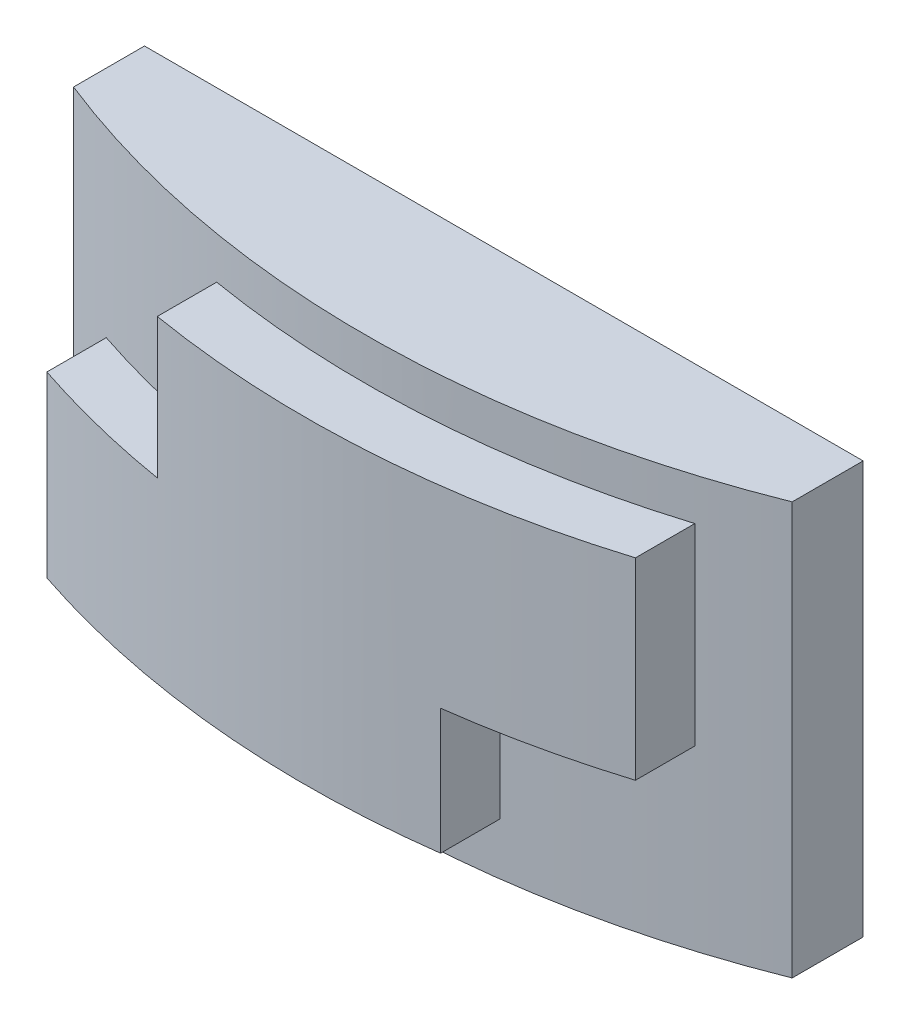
ISO-10303-21;
HEADER;
FILE_DESCRIPTION(('STEP AP214'),'2;1');
FILE_NAME('part.step','',(''),(''),'','','');
FILE_SCHEMA(('AUTOMOTIVE_DESIGN { 1 0 10303 214 1 1 1 1 }'));
ENDSEC;
DATA;
#1=APPLICATION_CONTEXT('core data for automotive mechanical design processes');
#2=APPLICATION_PROTOCOL_DEFINITION('international standard','automotive_design',2000,#1);
#3=PRODUCT_CONTEXT('',#1,'mechanical');
#4=PRODUCT('Part','Part','',(#3));
#5=PRODUCT_RELATED_PRODUCT_CATEGORY('part','',(#4));
#6=PRODUCT_DEFINITION_FORMATION('','',#4);
#7=PRODUCT_DEFINITION_CONTEXT('part definition',#1,'design');
#8=PRODUCT_DEFINITION('design','',#6,#7);
#9=PRODUCT_DEFINITION_SHAPE('','',#8);
#10=(LENGTH_UNIT() NAMED_UNIT(*) SI_UNIT(.MILLI.,.METRE.));
#11=(NAMED_UNIT(*) PLANE_ANGLE_UNIT() SI_UNIT($,.RADIAN.));
#12=(NAMED_UNIT(*) SI_UNIT($,.STERADIAN.) SOLID_ANGLE_UNIT());
#13=UNCERTAINTY_MEASURE_WITH_UNIT(LENGTH_MEASURE(1.E-05),#10,'distance_accuracy_value','');
#14=(GEOMETRIC_REPRESENTATION_CONTEXT(3) GLOBAL_UNCERTAINTY_ASSIGNED_CONTEXT((#13)) GLOBAL_UNIT_ASSIGNED_CONTEXT((#10,
#11,#12)) REPRESENTATION_CONTEXT('',''));
#15=CARTESIAN_POINT('',(0.,0.,0.));
#16=DIRECTION('',(0.,0.,1.));
#17=DIRECTION('',(1.,0.,0.));
#18=AXIS2_PLACEMENT_3D('',#15,#16,#17);
#19=CARTESIAN_POINT('',(1.12058823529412,69.4428014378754,-152.267457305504));
#20=DIRECTION('',(0.,-1.,0.));
#21=DIRECTION('',(0.,0.,-1.));
#22=AXIS2_PLACEMENT_3D('',#19,#20,#21);
#23=CYLINDRICAL_SURFACE('',#22,163.850701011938);
#24=CARTESIAN_POINT('',(1.12058823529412,38.8031000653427,-152.267457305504));
#25=DIRECTION('',(0.,-1.,0.));
#26=DIRECTION('',(0.,0.,-1.));
#27=AXIS2_PLACEMENT_3D('',#24,#25,#26);
#28=CIRCLE('',#27,163.850701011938);
#29=CARTESIAN_POINT('',(-25.9572192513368,38.8031000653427,9.33032907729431));
#30=VERTEX_POINT('',#29);
#31=CARTESIAN_POINT('',(-50.712715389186,38.8031000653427,3.16857731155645));
#32=VERTEX_POINT('',#31);
#33=EDGE_CURVE('E47',#30,#32,#28,.T.);
#34=ORIENTED_EDGE('',*,*,#33,.F.);
#35=DIRECTION('',(0.,-1.,0.));
#36=VECTOR('',#35,1.);
#37=CARTESIAN_POINT('',(-25.9572192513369,69.4428014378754,9.33032907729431));
#38=LINE('',#37,#36);
#39=CARTESIAN_POINT('',(-25.9572192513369,62.356873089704,9.33032907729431));
#40=VERTEX_POINT('',#39);
#41=EDGE_CURVE('E125',#40,#30,#38,.T.);
#42=ORIENTED_EDGE('',*,*,#41,.F.);
#43=CARTESIAN_POINT('',(1.12058823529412,62.356873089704,-152.267457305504));
#44=DIRECTION('',(0.,-1.,0.));
#45=DIRECTION('',(1.,0.,0.));
#46=AXIS2_PLACEMENT_3D('',#43,#44,#45);
#47=CIRCLE('',#46,163.850701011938);
#48=CARTESIAN_POINT('',(49.5109922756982,62.3568730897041,4.27461697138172));
#49=VERTEX_POINT('',#48);
#50=EDGE_CURVE('E118',#49,#40,#47,.T.);
#51=ORIENTED_EDGE('',*,*,#50,.F.);
#52=DIRECTION('',(0.,-1.,0.));
#53=VECTOR('',#52,1.);
#54=CARTESIAN_POINT('',(49.5109922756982,69.4428014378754,4.27461697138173));
#55=LINE('',#54,#53);
#56=CARTESIAN_POINT('',(49.5109922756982,29.9103490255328,4.27461697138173));
#57=VERTEX_POINT('',#56);
#58=EDGE_CURVE('E122',#49,#57,#55,.T.);
#59=ORIENTED_EDGE('',*,*,#58,.T.);
#60=CARTESIAN_POINT('',(1.12058823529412,29.9103490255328,-152.267457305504));
#61=DIRECTION('',(0.,1.,0.));
#62=DIRECTION('',(0.,0.,1.));
#63=AXIS2_PLACEMENT_3D('',#60,#61,#62);
#64=CIRCLE('',#63,163.850701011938);
#65=CARTESIAN_POINT('',(22.592394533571,29.9103490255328,10.1702653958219));
#66=VERTEX_POINT('',#65);
#67=EDGE_CURVE('E148',#66,#57,#64,.T.);
#68=ORIENTED_EDGE('',*,*,#67,.F.);
#69=DIRECTION('',(0.,-1.,0.));
#70=VECTOR('',#69,1.);
#71=CARTESIAN_POINT('',(22.592394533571,69.4428014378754,10.1702653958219));
#72=LINE('',#71,#70);
#73=CARTESIAN_POINT('',(22.592394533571,8.76002222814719,10.1702653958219));
#74=VERTEX_POINT('',#73);
#75=EDGE_CURVE('E154',#66,#74,#72,.T.);
#76=ORIENTED_EDGE('',*,*,#75,.T.);
#77=CARTESIAN_POINT('',(1.12058823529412,8.76002222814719,-152.267457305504));
#78=DIRECTION('',(0.,1.,0.));
#79=DIRECTION('',(-1.,0.,0.));
#80=AXIS2_PLACEMENT_3D('',#77,#78,#79);
#81=CIRCLE('',#80,163.850701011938);
#82=CARTESIAN_POINT('',(-50.712715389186,8.7600222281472,3.16857731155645));
#83=VERTEX_POINT('',#82);
#84=EDGE_CURVE('E158',#83,#74,#81,.T.);
#85=ORIENTED_EDGE('',*,*,#84,.F.);
#86=DIRECTION('',(0.,-1.,0.));
#87=VECTOR('',#86,1.);
#88=CARTESIAN_POINT('',(-50.712715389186,69.4428014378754,3.16857731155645));
#89=LINE('',#88,#87);
#90=EDGE_CURVE('E52',#32,#83,#89,.T.);
#91=ORIENTED_EDGE('',*,*,#90,.F.);
#92=EDGE_LOOP('',(#34,#42,#51,#59,#68,#76,#85,#91));
#93=FACE_BOUND('',#92,.T.);
#94=CARTESIAN_POINT('',(1.12058823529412,0.,-152.267457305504));
#95=DIRECTION('',(0.,1.,0.));
#96=DIRECTION('',(0.,0.,1.));
#97=AXIS2_PLACEMENT_3D('',#94,#95,#96);
#98=CIRCLE('',#97,163.850701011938);
#99=CARTESIAN_POINT('',(-59.3911764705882,0.,0.));
#100=VERTEX_POINT('',#99);
#101=CARTESIAN_POINT('',(61.6323529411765,0.,0.));
#102=VERTEX_POINT('',#101);
#103=EDGE_CURVE('E183',#100,#102,#98,.T.);
#104=ORIENTED_EDGE('',*,*,#103,.T.);
#105=DIRECTION('',(0.,-1.,0.));
#106=VECTOR('',#105,1.);
#107=CARTESIAN_POINT('',(61.6323529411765,69.4428014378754,0.));
#108=LINE('',#107,#106);
#109=CARTESIAN_POINT('',(61.6323529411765,69.4428014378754,0.));
#110=VERTEX_POINT('',#109);
#111=EDGE_CURVE('E11',#110,#102,#108,.T.);
#112=ORIENTED_EDGE('',*,*,#111,.F.);
#113=CARTESIAN_POINT('',(1.12058823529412,69.4428014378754,-152.267457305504));
#114=DIRECTION('',(0.,1.,0.));
#115=DIRECTION('',(0.,0.,1.));
#116=AXIS2_PLACEMENT_3D('',#113,#114,#115);
#117=CIRCLE('',#116,163.850701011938);
#118=CARTESIAN_POINT('',(-59.3911764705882,69.4428014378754,0.));
#119=VERTEX_POINT('',#118);
#120=EDGE_CURVE('E192',#119,#110,#117,.T.);
#121=ORIENTED_EDGE('',*,*,#120,.F.);
#122=DIRECTION('',(0.,-1.,0.));
#123=VECTOR('',#122,1.);
#124=CARTESIAN_POINT('',(-59.3911764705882,69.4428014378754,0.));
#125=LINE('',#124,#123);
#126=EDGE_CURVE('E201',#119,#100,#125,.T.);
#127=ORIENTED_EDGE('',*,*,#126,.T.);
#128=EDGE_LOOP('',(#104,#112,#121,#127));
#129=FACE_BOUND('',#128,.T.);
#130=ADVANCED_FACE('F33',(#93,#129),#23,.T.);
#131=CARTESIAN_POINT('',(61.6323529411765,69.4428014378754,-11.9529411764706));
#132=DIRECTION('',(-1.,0.,0.));
#133=DIRECTION('',(0.,0.,1.));
#134=AXIS2_PLACEMENT_3D('',#131,#132,#133);
#135=PLANE('',#134);
#136=DIRECTION('',(0.,0.,-1.));
#137=VECTOR('',#136,1.);
#138=CARTESIAN_POINT('',(61.6323529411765,0.,-11.9529411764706));
#139=LINE('',#138,#137);
#140=CARTESIAN_POINT('',(61.6323529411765,0.,-11.9529411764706));
#141=VERTEX_POINT('',#140);
#142=EDGE_CURVE('E186',#102,#141,#139,.T.);
#143=ORIENTED_EDGE('',*,*,#142,.T.);
#144=DIRECTION('',(0.,-1.,0.));
#145=VECTOR('',#144,1.);
#146=CARTESIAN_POINT('',(61.6323529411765,69.4428014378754,-11.9529411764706));
#147=LINE('',#146,#145);
#148=CARTESIAN_POINT('',(61.6323529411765,69.4428014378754,-11.9529411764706));
#149=VERTEX_POINT('',#148);
#150=EDGE_CURVE('E40',#149,#141,#147,.T.);
#151=ORIENTED_EDGE('',*,*,#150,.F.);
#152=DIRECTION('',(0.,0.,-1.));
#153=VECTOR('',#152,1.);
#154=CARTESIAN_POINT('',(61.6323529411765,69.4428014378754,-11.9529411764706));
#155=LINE('',#154,#153);
#156=EDGE_CURVE('E195',#110,#149,#155,.T.);
#157=ORIENTED_EDGE('',*,*,#156,.F.);
#158=ORIENTED_EDGE('',*,*,#111,.T.);
#159=EDGE_LOOP('',(#143,#151,#157,#158));
#160=FACE_BOUND('',#159,.T.);
#161=ADVANCED_FACE('F226',(#160),#135,.F.);
#162=CARTESIAN_POINT('',(-59.3911764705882,69.4428014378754,-11.9529411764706));
#163=DIRECTION('',(0.,0.,1.));
#164=DIRECTION('',(1.,0.,0.));
#165=AXIS2_PLACEMENT_3D('',#162,#163,#164);
#166=PLANE('',#165);
#167=DIRECTION('',(-1.,0.,0.));
#168=VECTOR('',#167,1.);
#169=CARTESIAN_POINT('',(-59.3911764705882,0.,-11.9529411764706));
#170=LINE('',#169,#168);
#171=CARTESIAN_POINT('',(-59.3911764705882,0.,-11.9529411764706));
#172=VERTEX_POINT('',#171);
#173=EDGE_CURVE('E188',#141,#172,#170,.T.);
#174=ORIENTED_EDGE('',*,*,#173,.T.);
#175=DIRECTION('',(0.,-1.,0.));
#176=VECTOR('',#175,1.);
#177=CARTESIAN_POINT('',(-59.3911764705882,69.4428014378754,-11.9529411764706));
#178=LINE('',#177,#176);
#179=CARTESIAN_POINT('',(-59.3911764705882,69.4428014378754,-11.9529411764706));
#180=VERTEX_POINT('',#179);
#181=EDGE_CURVE('E204',#180,#172,#178,.T.);
#182=ORIENTED_EDGE('',*,*,#181,.F.);
#183=DIRECTION('',(-1.,0.,0.));
#184=VECTOR('',#183,1.);
#185=CARTESIAN_POINT('',(-59.3911764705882,69.4428014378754,-11.9529411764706));
#186=LINE('',#185,#184);
#187=EDGE_CURVE('E197',#149,#180,#186,.T.);
#188=ORIENTED_EDGE('',*,*,#187,.F.);
#189=ORIENTED_EDGE('',*,*,#150,.T.);
#190=EDGE_LOOP('',(#174,#182,#188,#189));
#191=FACE_BOUND('',#190,.T.);
#192=ADVANCED_FACE('F211',(#191),#166,.F.);
#193=CARTESIAN_POINT('',(-59.3911764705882,69.4428014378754,0.));
#194=DIRECTION('',(1.,0.,0.));
#195=DIRECTION('',(0.,0.,-1.));
#196=AXIS2_PLACEMENT_3D('',#193,#194,#195);
#197=PLANE('',#196);
#198=DIRECTION('',(0.,0.,1.));
#199=VECTOR('',#198,1.);
#200=CARTESIAN_POINT('',(-59.3911764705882,0.,0.));
#201=LINE('',#200,#199);
#202=EDGE_CURVE('E190',#172,#100,#201,.T.);
#203=ORIENTED_EDGE('',*,*,#202,.T.);
#204=ORIENTED_EDGE('',*,*,#126,.F.);
#205=DIRECTION('',(0.,0.,1.));
#206=VECTOR('',#205,1.);
#207=CARTESIAN_POINT('',(-59.3911764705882,69.4428014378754,0.));
#208=LINE('',#207,#206);
#209=EDGE_CURVE('E199',#180,#119,#208,.T.);
#210=ORIENTED_EDGE('',*,*,#209,.F.);
#211=ORIENTED_EDGE('',*,*,#181,.T.);
#212=EDGE_LOOP('',(#203,#204,#210,#211));
#213=FACE_BOUND('',#212,.T.);
#214=ADVANCED_FACE('F220',(#213),#197,.F.);
#215=CARTESIAN_POINT('',(1.12058823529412,69.4428014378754,-152.267457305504));
#216=DIRECTION('',(0.,1.,0.));
#217=DIRECTION('',(0.,0.,1.));
#218=AXIS2_PLACEMENT_3D('',#215,#216,#217);
#219=PLANE('',#218);
#220=ORIENTED_EDGE('',*,*,#120,.T.);
#221=ORIENTED_EDGE('',*,*,#156,.T.);
#222=ORIENTED_EDGE('',*,*,#187,.T.);
#223=ORIENTED_EDGE('',*,*,#209,.T.);
#224=EDGE_LOOP('',(#220,#221,#222,#223));
#225=FACE_BOUND('',#224,.T.);
#226=ADVANCED_FACE('F225',(#225),#219,.T.);
#227=CARTESIAN_POINT('',(1.12058823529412,0.,-152.267457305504));
#228=DIRECTION('',(0.,1.,0.));
#229=DIRECTION('',(0.,0.,1.));
#230=AXIS2_PLACEMENT_3D('',#227,#228,#229);
#231=PLANE('',#230);
#232=ORIENTED_EDGE('',*,*,#103,.F.);
#233=ORIENTED_EDGE('',*,*,#202,.F.);
#234=ORIENTED_EDGE('',*,*,#173,.F.);
#235=ORIENTED_EDGE('',*,*,#142,.F.);
#236=EDGE_LOOP('',(#232,#233,#234,#235));
#237=FACE_BOUND('',#236,.T.);
#238=ADVANCED_FACE('F217',(#237),#231,.F.);
#239=CARTESIAN_POINT('',(1.12058823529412,69.4428014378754,-142.267457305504));
#240=DIRECTION('',(0.,-1.,0.));
#241=DIRECTION('',(0.,0.,-1.));
#242=AXIS2_PLACEMENT_3D('',#239,#240,#241);
#243=CYLINDRICAL_SURFACE('',#242,163.850701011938);
#244=DIRECTION('',(0.,-1.,0.));
#245=VECTOR('',#244,1.);
#246=CARTESIAN_POINT('',(22.592394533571,69.4428014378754,20.1702653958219));
#247=LINE('',#246,#245);
#248=CARTESIAN_POINT('',(22.592394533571,29.9103490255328,20.1702653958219));
#249=VERTEX_POINT('',#248);
#250=CARTESIAN_POINT('',(22.592394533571,8.76002222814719,20.1702653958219));
#251=VERTEX_POINT('',#250);
#252=EDGE_CURVE('E151',#249,#251,#247,.T.);
#253=ORIENTED_EDGE('',*,*,#252,.F.);
#254=CARTESIAN_POINT('',(1.12058823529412,29.9103490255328,-142.267457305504));
#255=DIRECTION('',(0.,1.,0.));
#256=DIRECTION('',(0.,0.,1.));
#257=AXIS2_PLACEMENT_3D('',#254,#255,#256);
#258=CIRCLE('',#257,163.850701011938);
#259=CARTESIAN_POINT('',(49.5109922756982,29.9103490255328,14.2746169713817));
#260=VERTEX_POINT('',#259);
#261=EDGE_CURVE('E169',#249,#260,#258,.T.);
#262=ORIENTED_EDGE('',*,*,#261,.T.);
#263=DIRECTION('',(0.,-1.,0.));
#264=VECTOR('',#263,1.);
#265=CARTESIAN_POINT('',(49.5109922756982,69.4428014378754,14.2746169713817));
#266=LINE('',#265,#264);
#267=CARTESIAN_POINT('',(49.5109922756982,62.3568730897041,14.2746169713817));
#268=VERTEX_POINT('',#267);
#269=EDGE_CURVE('E138',#268,#260,#266,.T.);
#270=ORIENTED_EDGE('',*,*,#269,.F.);
#271=CARTESIAN_POINT('',(1.12058823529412,62.356873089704,-142.267457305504));
#272=DIRECTION('',(0.,-1.,0.));
#273=DIRECTION('',(1.,0.,0.));
#274=AXIS2_PLACEMENT_3D('',#271,#272,#273);
#275=CIRCLE('',#274,163.850701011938);
#276=CARTESIAN_POINT('',(-25.9572192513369,62.356873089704,19.3303290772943));
#277=VERTEX_POINT('',#276);
#278=EDGE_CURVE('E130',#268,#277,#275,.T.);
#279=ORIENTED_EDGE('',*,*,#278,.T.);
#280=DIRECTION('',(0.,-1.,0.));
#281=VECTOR('',#280,1.);
#282=CARTESIAN_POINT('',(-25.9572192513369,69.4428014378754,19.3303290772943));
#283=LINE('',#282,#281);
#284=CARTESIAN_POINT('',(-25.9572192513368,38.8031000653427,19.3303290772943));
#285=VERTEX_POINT('',#284);
#286=EDGE_CURVE('E166',#277,#285,#283,.T.);
#287=ORIENTED_EDGE('',*,*,#286,.T.);
#288=CARTESIAN_POINT('',(1.12058823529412,38.8031000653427,-142.267457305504));
#289=DIRECTION('',(0.,-1.,0.));
#290=DIRECTION('',(0.,0.,-1.));
#291=AXIS2_PLACEMENT_3D('',#288,#289,#290);
#292=CIRCLE('',#291,163.850701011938);
#293=CARTESIAN_POINT('',(-50.7127153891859,38.8031000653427,13.1685773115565));
#294=VERTEX_POINT('',#293);
#295=EDGE_CURVE('E163',#285,#294,#292,.T.);
#296=ORIENTED_EDGE('',*,*,#295,.T.);
#297=DIRECTION('',(0.,-1.,0.));
#298=VECTOR('',#297,1.);
#299=CARTESIAN_POINT('',(-50.712715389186,69.4428014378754,13.1685773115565));
#300=LINE('',#299,#298);
#301=CARTESIAN_POINT('',(-50.712715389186,8.76002222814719,13.1685773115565));
#302=VERTEX_POINT('',#301);
#303=EDGE_CURVE('E160',#294,#302,#300,.T.);
#304=ORIENTED_EDGE('',*,*,#303,.T.);
#305=CARTESIAN_POINT('',(1.12058823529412,8.76002222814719,-142.267457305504));
#306=DIRECTION('',(0.,1.,0.));
#307=DIRECTION('',(-1.,0.,0.));
#308=AXIS2_PLACEMENT_3D('',#305,#306,#307);
#309=CIRCLE('',#308,163.850701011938);
#310=EDGE_CURVE('E156',#302,#251,#309,.T.);
#311=ORIENTED_EDGE('',*,*,#310,.T.);
#312=EDGE_LOOP('',(#253,#262,#270,#279,#287,#296,#304,#311));
#313=FACE_BOUND('',#312,.T.);
#314=ADVANCED_FACE('F240',(#313),#243,.T.);
#315=CARTESIAN_POINT('',(49.5109922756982,29.9103490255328,4.27461697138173));
#316=DIRECTION('',(0.,-1.,0.));
#317=DIRECTION('',(0.,0.,-1.));
#318=AXIS2_PLACEMENT_3D('',#315,#316,#317);
#319=PLANE('',#318);
#320=ORIENTED_EDGE('',*,*,#261,.F.);
#321=DIRECTION('',(0.,0.,1.));
#322=VECTOR('',#321,1.);
#323=CARTESIAN_POINT('',(22.592394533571,29.9103490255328,10.1702653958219));
#324=LINE('',#323,#322);
#325=EDGE_CURVE('E150',#66,#249,#324,.T.);
#326=ORIENTED_EDGE('',*,*,#325,.F.);
#327=ORIENTED_EDGE('',*,*,#67,.T.);
#328=DIRECTION('',(0.,0.,1.));
#329=VECTOR('',#328,1.);
#330=CARTESIAN_POINT('',(49.5109922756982,29.9103490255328,4.27461697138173));
#331=LINE('',#330,#329);
#332=EDGE_CURVE('E142',#57,#260,#331,.T.);
#333=ORIENTED_EDGE('',*,*,#332,.T.);
#334=EDGE_LOOP('',(#320,#326,#327,#333));
#335=FACE_BOUND('',#334,.T.);
#336=ADVANCED_FACE('F243',(#335),#319,.T.);
#337=CARTESIAN_POINT('',(-25.9572192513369,62.356873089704,9.33032907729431));
#338=DIRECTION('',(0.,1.,0.));
#339=DIRECTION('',(-1.,0.,0.));
#340=AXIS2_PLACEMENT_3D('',#337,#338,#339);
#341=PLANE('',#340);
#342=ORIENTED_EDGE('',*,*,#278,.F.);
#343=DIRECTION('',(0.,0.,1.));
#344=VECTOR('',#343,1.);
#345=CARTESIAN_POINT('',(49.5109922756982,62.3568730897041,4.27461697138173));
#346=LINE('',#345,#344);
#347=EDGE_CURVE('E134',#49,#268,#346,.T.);
#348=ORIENTED_EDGE('',*,*,#347,.F.);
#349=ORIENTED_EDGE('',*,*,#50,.T.);
#350=DIRECTION('',(0.,0.,1.));
#351=VECTOR('',#350,1.);
#352=CARTESIAN_POINT('',(-25.9572192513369,62.356873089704,9.33032907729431));
#353=LINE('',#352,#351);
#354=EDGE_CURVE('E129',#40,#277,#353,.T.);
#355=ORIENTED_EDGE('',*,*,#354,.T.);
#356=EDGE_LOOP('',(#342,#348,#349,#355));
#357=FACE_BOUND('',#356,.T.);
#358=ADVANCED_FACE('F135',(#357),#341,.T.);
#359=CARTESIAN_POINT('',(-25.9572192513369,69.4428014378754,9.33032907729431));
#360=DIRECTION('',(-1.,0.,0.));
#361=DIRECTION('',(0.,0.,1.));
#362=AXIS2_PLACEMENT_3D('',#359,#360,#361);
#363=PLANE('',#362);
#364=ORIENTED_EDGE('',*,*,#286,.F.);
#365=ORIENTED_EDGE('',*,*,#354,.F.);
#366=ORIENTED_EDGE('',*,*,#41,.T.);
#367=DIRECTION('',(0.,0.,1.));
#368=VECTOR('',#367,1.);
#369=CARTESIAN_POINT('',(-25.9572192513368,38.8031000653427,9.33032907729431));
#370=LINE('',#369,#368);
#371=EDGE_CURVE('E165',#30,#285,#370,.T.);
#372=ORIENTED_EDGE('',*,*,#371,.T.);
#373=EDGE_LOOP('',(#364,#365,#366,#372));
#374=FACE_BOUND('',#373,.T.);
#375=ADVANCED_FACE('F260',(#374),#363,.T.);
#376=CARTESIAN_POINT('',(-50.712715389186,38.8031000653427,3.16857731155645));
#377=DIRECTION('',(0.,1.,0.));
#378=DIRECTION('',(0.,0.,1.));
#379=AXIS2_PLACEMENT_3D('',#376,#377,#378);
#380=PLANE('',#379);
#381=ORIENTED_EDGE('',*,*,#295,.F.);
#382=ORIENTED_EDGE('',*,*,#371,.F.);
#383=ORIENTED_EDGE('',*,*,#33,.T.);
#384=DIRECTION('',(0.,0.,1.));
#385=VECTOR('',#384,1.);
#386=CARTESIAN_POINT('',(-50.712715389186,38.8031000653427,3.16857731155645));
#387=LINE('',#386,#385);
#388=EDGE_CURVE('E162',#32,#294,#387,.T.);
#389=ORIENTED_EDGE('',*,*,#388,.T.);
#390=EDGE_LOOP('',(#381,#382,#383,#389));
#391=FACE_BOUND('',#390,.T.);
#392=ADVANCED_FACE('F256',(#391),#380,.T.);
#393=CARTESIAN_POINT('',(-50.712715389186,69.4428014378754,3.16857731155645));
#394=DIRECTION('',(-1.,0.,0.));
#395=DIRECTION('',(0.,0.,1.));
#396=AXIS2_PLACEMENT_3D('',#393,#394,#395);
#397=PLANE('',#396);
#398=ORIENTED_EDGE('',*,*,#303,.F.);
#399=ORIENTED_EDGE('',*,*,#388,.F.);
#400=ORIENTED_EDGE('',*,*,#90,.T.);
#401=DIRECTION('',(0.,0.,1.));
#402=VECTOR('',#401,1.);
#403=CARTESIAN_POINT('',(-50.712715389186,8.7600222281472,3.16857731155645));
#404=LINE('',#403,#402);
#405=EDGE_CURVE('E159',#83,#302,#404,.T.);
#406=ORIENTED_EDGE('',*,*,#405,.T.);
#407=EDGE_LOOP('',(#398,#399,#400,#406));
#408=FACE_BOUND('',#407,.T.);
#409=ADVANCED_FACE('F252',(#408),#397,.T.);
#410=CARTESIAN_POINT('',(22.592394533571,8.76002222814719,10.1702653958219));
#411=DIRECTION('',(0.,-1.,0.));
#412=DIRECTION('',(1.,0.,0.));
#413=AXIS2_PLACEMENT_3D('',#410,#411,#412);
#414=PLANE('',#413);
#415=ORIENTED_EDGE('',*,*,#310,.F.);
#416=ORIENTED_EDGE('',*,*,#405,.F.);
#417=ORIENTED_EDGE('',*,*,#84,.T.);
#418=DIRECTION('',(0.,0.,1.));
#419=VECTOR('',#418,1.);
#420=CARTESIAN_POINT('',(22.592394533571,8.76002222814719,10.1702653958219));
#421=LINE('',#420,#419);
#422=EDGE_CURVE('E155',#74,#251,#421,.T.);
#423=ORIENTED_EDGE('',*,*,#422,.T.);
#424=EDGE_LOOP('',(#415,#416,#417,#423));
#425=FACE_BOUND('',#424,.T.);
#426=ADVANCED_FACE('F248',(#425),#414,.T.);
#427=CARTESIAN_POINT('',(22.592394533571,69.4428014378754,10.1702653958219));
#428=DIRECTION('',(-1.,0.,0.));
#429=DIRECTION('',(0.,0.,1.));
#430=AXIS2_PLACEMENT_3D('',#427,#428,#429);
#431=PLANE('',#430);
#432=ORIENTED_EDGE('',*,*,#252,.T.);
#433=ORIENTED_EDGE('',*,*,#422,.F.);
#434=ORIENTED_EDGE('',*,*,#75,.F.);
#435=ORIENTED_EDGE('',*,*,#325,.T.);
#436=EDGE_LOOP('',(#432,#433,#434,#435));
#437=FACE_BOUND('',#436,.T.);
#438=ADVANCED_FACE('F245',(#437),#431,.F.);
#439=CARTESIAN_POINT('',(49.5109922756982,69.4428014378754,4.27461697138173));
#440=DIRECTION('',(-1.,0.,0.));
#441=DIRECTION('',(0.,0.,1.));
#442=AXIS2_PLACEMENT_3D('',#439,#440,#441);
#443=PLANE('',#442);
#444=ORIENTED_EDGE('',*,*,#269,.T.);
#445=ORIENTED_EDGE('',*,*,#332,.F.);
#446=ORIENTED_EDGE('',*,*,#58,.F.);
#447=ORIENTED_EDGE('',*,*,#347,.T.);
#448=EDGE_LOOP('',(#444,#445,#446,#447));
#449=FACE_BOUND('',#448,.T.);
#450=ADVANCED_FACE('F140',(#449),#443,.F.);
#451=CLOSED_SHELL('',(#130,#161,#192,#214,#226,#238,#314,#336,#358,#375,#392,#409,#426,#438,#450));
#452=MANIFOLD_SOLID_BREP('B2',#451);
#453=ADVANCED_BREP_SHAPE_REPRESENTATION('',(#18,#452),#14);
#454=SHAPE_DEFINITION_REPRESENTATION(#9,#453);
ENDSEC;
END-ISO-10303-21;
